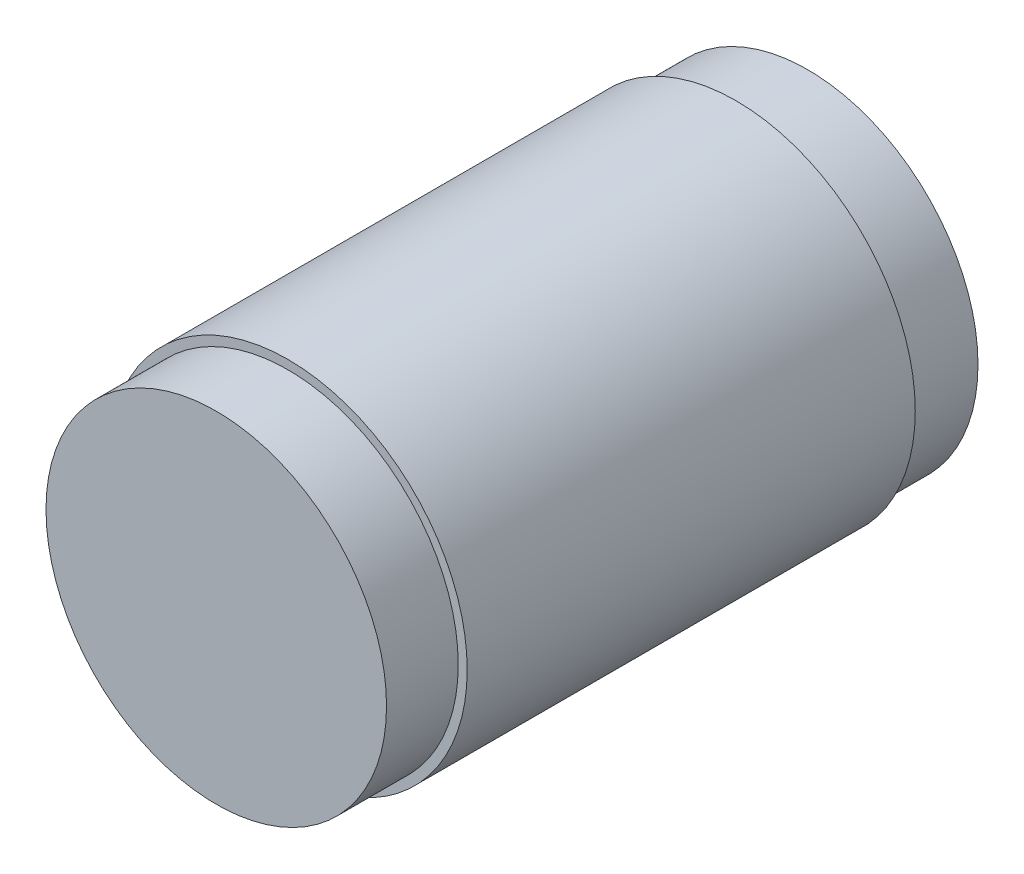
ISO-10303-21;
HEADER;
FILE_DESCRIPTION(('STEP AP214'),'2;1');
FILE_NAME('part.step','',(''),(''),'','','');
FILE_SCHEMA(('AUTOMOTIVE_DESIGN { 1 0 10303 214 1 1 1 1 }'));
ENDSEC;
DATA;
#1=APPLICATION_CONTEXT('core data for automotive mechanical design processes');
#2=APPLICATION_PROTOCOL_DEFINITION('international standard','automotive_design',2000,#1);
#3=PRODUCT_CONTEXT('',#1,'mechanical');
#4=PRODUCT('Part','Part','',(#3));
#5=PRODUCT_RELATED_PRODUCT_CATEGORY('part','',(#4));
#6=PRODUCT_DEFINITION_FORMATION('','',#4);
#7=PRODUCT_DEFINITION_CONTEXT('part definition',#1,'design');
#8=PRODUCT_DEFINITION('design','',#6,#7);
#9=PRODUCT_DEFINITION_SHAPE('','',#8);
#10=(LENGTH_UNIT() NAMED_UNIT(*) SI_UNIT(.MILLI.,.METRE.));
#11=(NAMED_UNIT(*) PLANE_ANGLE_UNIT() SI_UNIT($,.RADIAN.));
#12=(NAMED_UNIT(*) SI_UNIT($,.STERADIAN.) SOLID_ANGLE_UNIT());
#13=UNCERTAINTY_MEASURE_WITH_UNIT(LENGTH_MEASURE(1.E-05),#10,'distance_accuracy_value','');
#14=(GEOMETRIC_REPRESENTATION_CONTEXT(3) GLOBAL_UNCERTAINTY_ASSIGNED_CONTEXT((#13)) GLOBAL_UNIT_ASSIGNED_CONTEXT((#10,
#11,#12)) REPRESENTATION_CONTEXT('',''));
#15=CARTESIAN_POINT('',(0.,0.,0.));
#16=DIRECTION('',(0.,0.,1.));
#17=DIRECTION('',(1.,0.,0.));
#18=AXIS2_PLACEMENT_3D('',#15,#16,#17);
#19=CARTESIAN_POINT('',(0.,-8.78250645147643,33.6234162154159));
#20=DIRECTION('',(0.,0.,1.));
#21=DIRECTION('',(1.,0.,0.));
#22=AXIS2_PLACEMENT_3D('',#19,#20,#21);
#23=CYLINDRICAL_SURFACE('',#22,9.5);
#24=CARTESIAN_POINT('',(0.,-8.78250645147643,33.6234162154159));
#25=DIRECTION('',(0.,0.,1.));
#26=DIRECTION('',(1.,0.,0.));
#27=AXIS2_PLACEMENT_3D('',#24,#25,#26);
#28=CIRCLE('',#27,9.5);
#29=CARTESIAN_POINT('',(9.5,-8.78250645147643,33.6234162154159));
#30=VERTEX_POINT('',#29);
#31=EDGE_CURVE('E10',#30,#30,#28,.T.);
#32=ORIENTED_EDGE('',*,*,#31,.F.);
#33=EDGE_LOOP('',(#32));
#34=FACE_BOUND('',#33,.T.);
#35=CARTESIAN_POINT('',(0.,-8.78250645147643,29.6234162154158));
#36=DIRECTION('',(0.,0.,1.));
#37=DIRECTION('',(1.,0.,0.));
#38=AXIS2_PLACEMENT_3D('',#35,#36,#37);
#39=CIRCLE('',#38,9.5);
#40=CARTESIAN_POINT('',(9.5,-8.78250645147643,29.6234162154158));
#41=VERTEX_POINT('',#40);
#42=EDGE_CURVE('E62',#41,#41,#39,.T.);
#43=ORIENTED_EDGE('',*,*,#42,.T.);
#44=EDGE_LOOP('',(#43));
#45=FACE_BOUND('',#44,.T.);
#46=ADVANCED_FACE('F34',(#34,#45),#23,.T.);
#47=CARTESIAN_POINT('',(0.,0.71749354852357,33.6234162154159));
#48=DIRECTION('',(0.,0.,-1.));
#49=DIRECTION('',(-1.,0.,0.));
#50=AXIS2_PLACEMENT_3D('',#47,#48,#49);
#51=PLANE('',#50);
#52=ORIENTED_EDGE('',*,*,#31,.T.);
#53=EDGE_LOOP('',(#52));
#54=FACE_BOUND('',#53,.T.);
#55=ADVANCED_FACE('F92',(#54),#51,.F.);
#56=CARTESIAN_POINT('',(0.,0.71749354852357,0.623416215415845));
#57=DIRECTION('',(0.,0.,1.));
#58=DIRECTION('',(1.,0.,0.));
#59=AXIS2_PLACEMENT_3D('',#56,#57,#58);
#60=PLANE('',#59);
#61=CARTESIAN_POINT('',(0.,-8.78250645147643,0.623416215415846));
#62=DIRECTION('',(0.,0.,1.));
#63=DIRECTION('',(1.,0.,0.));
#64=AXIS2_PLACEMENT_3D('',#61,#62,#63);
#65=CIRCLE('',#64,9.5);
#66=CARTESIAN_POINT('',(9.5,-8.78250645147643,0.623416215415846));
#67=VERTEX_POINT('',#66);
#68=EDGE_CURVE('E41',#67,#67,#65,.T.);
#69=ORIENTED_EDGE('',*,*,#68,.F.);
#70=EDGE_LOOP('',(#69));
#71=FACE_BOUND('',#70,.T.);
#72=ADVANCED_FACE('F87',(#71),#60,.F.);
#73=CARTESIAN_POINT('',(0.,-8.78250645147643,33.6234162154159));
#74=DIRECTION('',(0.,0.,1.));
#75=DIRECTION('',(1.,0.,0.));
#76=AXIS2_PLACEMENT_3D('',#73,#74,#75);
#77=CYLINDRICAL_SURFACE('',#76,9.5);
#78=CARTESIAN_POINT('',(0.,-8.78250645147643,4.62341621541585));
#79=DIRECTION('',(0.,0.,1.));
#80=DIRECTION('',(1.,0.,0.));
#81=AXIS2_PLACEMENT_3D('',#78,#79,#80);
#82=CIRCLE('',#81,9.5);
#83=CARTESIAN_POINT('',(9.5,-8.78250645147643,4.62341621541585));
#84=VERTEX_POINT('',#83);
#85=EDGE_CURVE('E48',#84,#84,#82,.T.);
#86=ORIENTED_EDGE('',*,*,#85,.F.);
#87=EDGE_LOOP('',(#86));
#88=FACE_BOUND('',#87,.T.);
#89=ORIENTED_EDGE('',*,*,#68,.T.);
#90=EDGE_LOOP('',(#89));
#91=FACE_BOUND('',#90,.T.);
#92=ADVANCED_FACE('F82',(#88,#91),#77,.T.);
#93=CARTESIAN_POINT('',(0.,1.21749354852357,4.62341621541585));
#94=DIRECTION('',(0.,0.,1.));
#95=DIRECTION('',(1.,0.,0.));
#96=AXIS2_PLACEMENT_3D('',#93,#94,#95);
#97=PLANE('',#96);
#98=CARTESIAN_POINT('',(0.,-8.78250645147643,4.62341621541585));
#99=DIRECTION('',(0.,0.,1.));
#100=DIRECTION('',(1.,0.,0.));
#101=AXIS2_PLACEMENT_3D('',#98,#99,#100);
#102=CIRCLE('',#101,10.);
#103=CARTESIAN_POINT('',(10.,-8.78250645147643,4.62341621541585));
#104=VERTEX_POINT('',#103);
#105=EDGE_CURVE('E54',#104,#104,#102,.T.);
#106=ORIENTED_EDGE('',*,*,#105,.F.);
#107=EDGE_LOOP('',(#106));
#108=FACE_BOUND('',#107,.T.);
#109=ORIENTED_EDGE('',*,*,#85,.T.);
#110=EDGE_LOOP('',(#109));
#111=FACE_BOUND('',#110,.T.);
#112=ADVANCED_FACE('F76',(#108,#111),#97,.F.);
#113=CARTESIAN_POINT('',(0.,-8.78250645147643,33.6234162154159));
#114=DIRECTION('',(0.,0.,1.));
#115=DIRECTION('',(1.,0.,0.));
#116=AXIS2_PLACEMENT_3D('',#113,#114,#115);
#117=CYLINDRICAL_SURFACE('',#116,10.);
#118=CARTESIAN_POINT('',(0.,-8.78250645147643,29.6234162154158));
#119=DIRECTION('',(0.,0.,1.));
#120=DIRECTION('',(1.,0.,0.));
#121=AXIS2_PLACEMENT_3D('',#118,#119,#120);
#122=CIRCLE('',#121,10.);
#123=CARTESIAN_POINT('',(10.,-8.78250645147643,29.6234162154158));
#124=VERTEX_POINT('',#123);
#125=EDGE_CURVE('E59',#124,#124,#122,.T.);
#126=ORIENTED_EDGE('',*,*,#125,.F.);
#127=EDGE_LOOP('',(#126));
#128=FACE_BOUND('',#127,.T.);
#129=ORIENTED_EDGE('',*,*,#105,.T.);
#130=EDGE_LOOP('',(#129));
#131=FACE_BOUND('',#130,.T.);
#132=ADVANCED_FACE('F70',(#128,#131),#117,.T.);
#133=CARTESIAN_POINT('',(0.,1.21749354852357,29.6234162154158));
#134=DIRECTION('',(0.,0.,-1.));
#135=DIRECTION('',(-1.,0.,0.));
#136=AXIS2_PLACEMENT_3D('',#133,#134,#135);
#137=PLANE('',#136);
#138=ORIENTED_EDGE('',*,*,#42,.F.);
#139=EDGE_LOOP('',(#138));
#140=FACE_BOUND('',#139,.T.);
#141=ORIENTED_EDGE('',*,*,#125,.T.);
#142=EDGE_LOOP('',(#141));
#143=FACE_BOUND('',#142,.T.);
#144=ADVANCED_FACE('F67',(#140,#143),#137,.F.);
#145=CLOSED_SHELL('',(#46,#55,#72,#92,#112,#132,#144));
#146=MANIFOLD_SOLID_BREP('B2',#145);
#147=ADVANCED_BREP_SHAPE_REPRESENTATION('',(#18,#146),#14);
#148=SHAPE_DEFINITION_REPRESENTATION(#9,#147);
ENDSEC;
END-ISO-10303-21;
